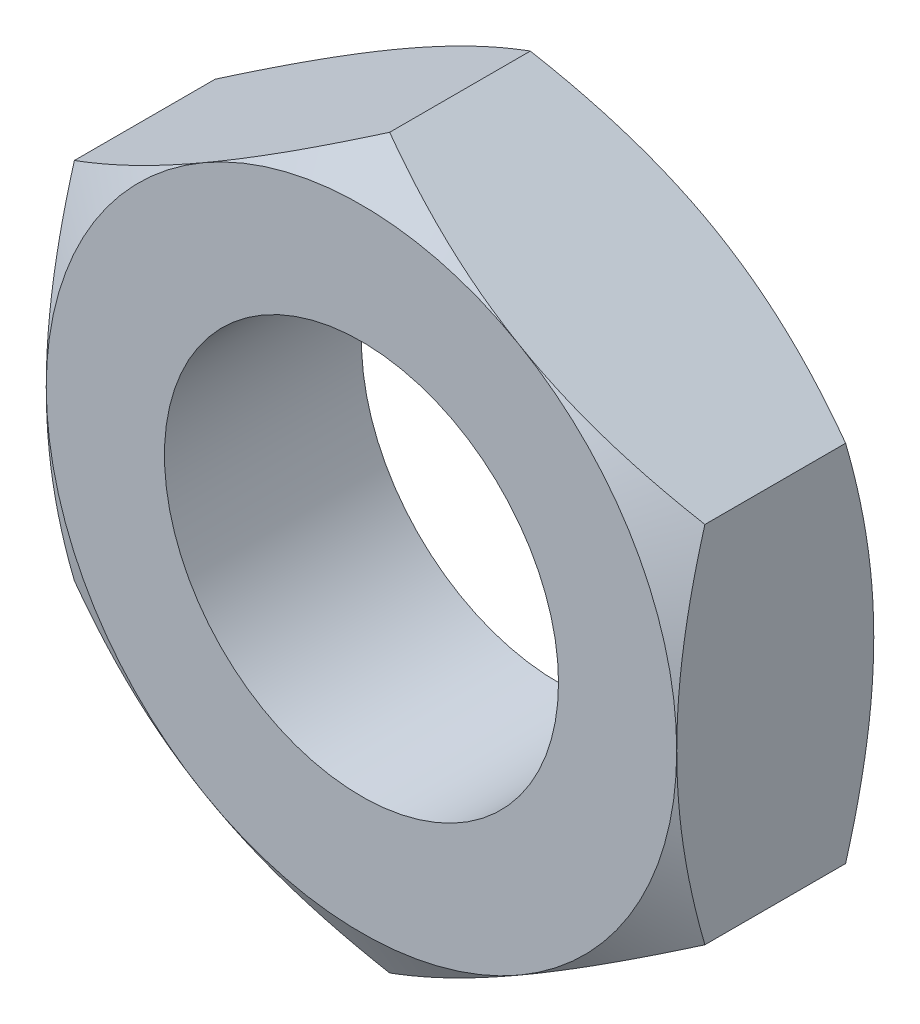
from build123d import *

# Parameters (mm, degrees)
BASE_EXTRUSION_DEPTH    = 5
ESQUISSE3_R             = 5
ENL_V_MAT_EXTRU_1_DEPTH = 14.20353488


with BuildPart() as part:
    # Esquisse1 → Base-Extrusion (new body)
    with BuildSketch(Plane.XY):
        Polygon((8, -4.618802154), (8, 4.618802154), (0, 9.237604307), (-8, 4.618802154), (-8, -4.618802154), (0, -9.237604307), align=None)
    extrude(amount=-BASE_EXTRUSION_DEPTH)

    # Esquisse2 → Enl_vement de mati_re-R_volution1 (revolve, cut)
    with BuildSketch(Plane(origin=(0, 0, 0), x_dir=(1, 0, 0), z_dir=(0, 1, 0)), mode=Mode.PRIVATE) as enl_vement_de_mati_re_r_volution1_sk:
        Polygon((-8, 0), (-13.330127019, 0), (-13.330127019, 5), (-8, 5), (-12.330127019, 2.5), align=None)
    revolve(enl_vement_de_mati_re_r_volution1_sk.sketch.rotate(Axis((0, 0, -5), (0, 0, 1)), 180), axis=Axis((0, 0, -5), (0, 0, 1)), mode=Mode.SUBTRACT)

    # Esquisse3 → Enl_v. mat.-Extru.1 (cut, through all)
    with BuildSketch(Plane.XY):
        Circle(ESQUISSE3_R)
    extrude(amount=-ENL_V_MAT_EXTRU_1_DEPTH, mode=Mode.SUBTRACT)


solid = part.part
